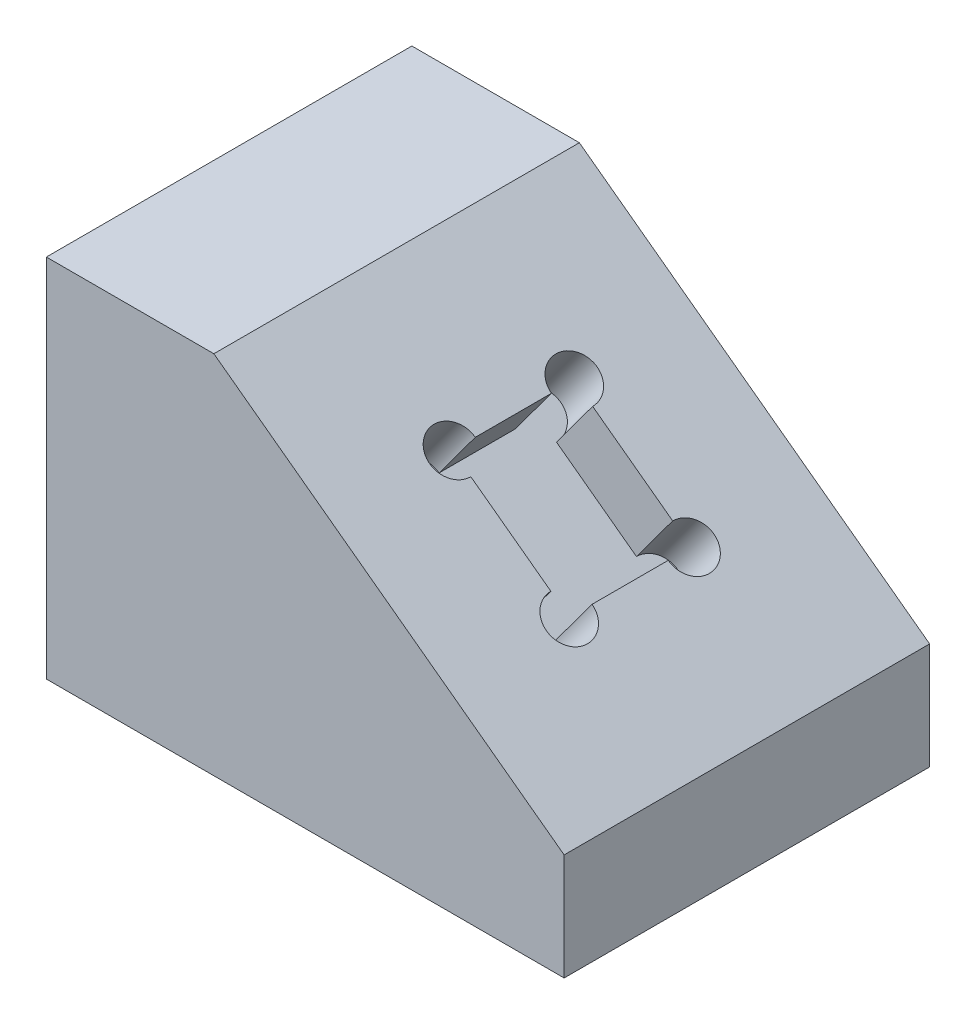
from build123d import *

# Parameters (mm, degrees)
BASE_EXTRUDE_DEPTH = 76.2
CUT_EXTRUDE1_DEPTH = 12.7


with BuildPart() as part:
    # Sketch1 → Base-Extrude (new body)
    with BuildSketch(Plane.XY):
        Polygon((34.925, 76.2), (107.95, 22.225), (107.95, 0), (0, 0), (0, 76.2), align=None)
    extrude(amount=-BASE_EXTRUDE_DEPTH)

    # Sketch2 → Cut-Extrude1 (cut)
    with BuildSketch(Plane(origin=(48.762255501, 65.972463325, 0), x_dir=(-0.8041761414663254, 0.5943910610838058, 0), z_dir=(0.5943910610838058, 0.8041761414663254, 0))):
        with BuildLine():
            Line((-38.568899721, -50.8), (-17.824826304, -50.8))
            ThreePointArc((-17.824826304, -50.8), (-9.694730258, -54.167596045), (-13.062326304, -46.0375))
            Line((-13.062326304, -46.0375), (-13.062326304, -30.1625))
            ThreePointArc((-13.062326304, -30.1625), (-9.694730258, -22.032403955), (-17.824826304, -25.4))
            Line((-17.824826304, -25.4), (-38.568899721, -25.4))
            ThreePointArc((-38.568899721, -25.4), (-46.698995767, -22.032403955), (-43.331399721, -30.1625))
            Line((-43.331399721, -30.1625), (-43.331399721, -46.0375))
            ThreePointArc((-43.331399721, -46.0375), (-46.698995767, -54.167596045), (-38.568899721, -50.8))
        make_face()
    extrude(amount=-CUT_EXTRUDE1_DEPTH, mode=Mode.SUBTRACT)


solid = part.part
